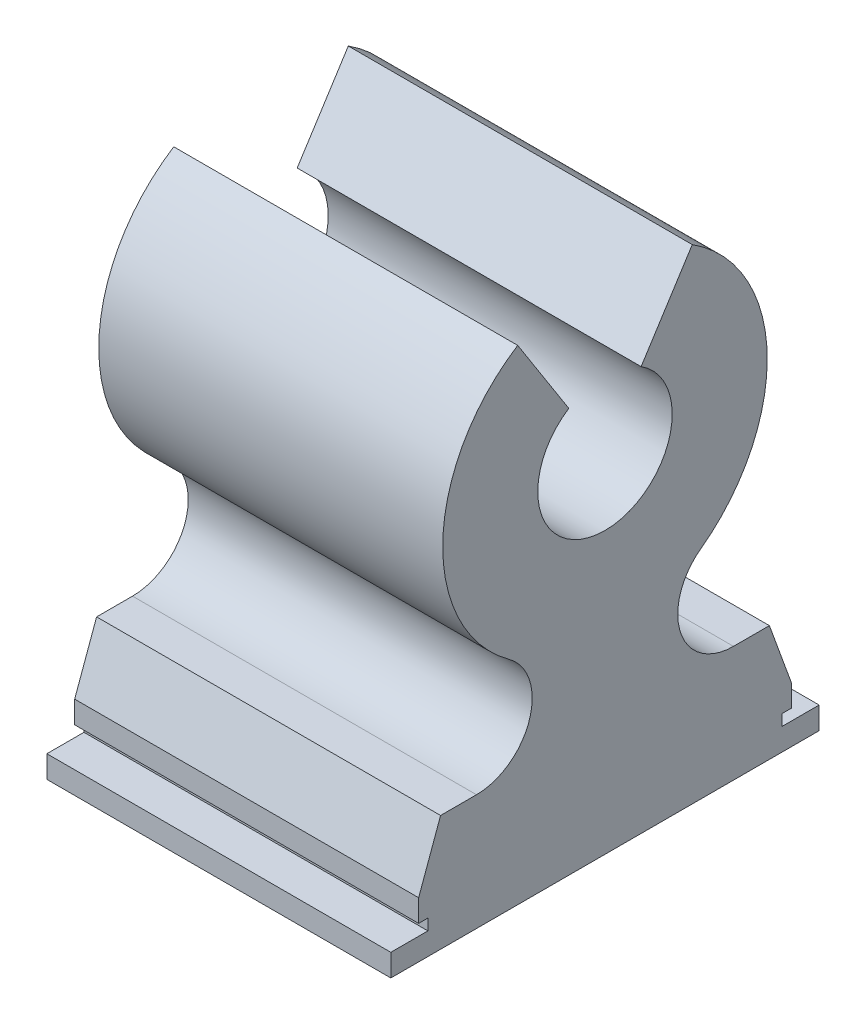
from build123d import *

# Parameters (mm, degrees)
BODY_DEPTH = 9.4234


with BuildPart() as part:
    # BodySke → Body (new body)
    with BuildSketch(Plane(origin=(0, 0, 0), x_dir=(0, 0, -1), z_dir=(1, 0, 0))):
        with BuildLine():
            Line((-5.8674, -9.525), (5.8674, -9.525))
            Line((5.8674, -9.525), (5.8674, -8.9154))
            Line((5.8674, -8.9154), (4.8514, -8.9154))
            Line((4.8514, -8.9154), (4.8514, -8.6106))
            Line((4.8514, -8.6106), (5.1054, -8.6106))
            Line((5.1054, -8.6106), (5.1054, -8.001))
            Line((5.1054, -8.001), (4.504485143, -6.35))
            Line((4.504485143, -6.35), (3.520438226, -6.35))
            ThreePointArc((3.520438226, -6.35), (2.069125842, -5.296760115), (2.620488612, -3.59041285))
            ThreePointArc((2.620488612, -3.59041285), (4.442829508, 0.138891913), (2.391103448, 3.747085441))
            Line((2.391103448, 3.747085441), (0.9906, 1.552363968))
            ThreePointArc((0.9906, 1.552363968), (0, -1.8415), (-0.9906, 1.552363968))
            Line((-0.9906, 1.552363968), (-2.391103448, 3.747085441))
            ThreePointArc((-2.391103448, 3.747085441), (-4.442829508, 0.138891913), (-2.620488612, -3.59041285))
            ThreePointArc((-2.620488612, -3.59041285), (-2.069125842, -5.296760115), (-3.520438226, -6.35))
            Line((-3.520438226, -6.35), (-4.504485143, -6.35))
            Line((-4.504485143, -6.35), (-5.1054, -8.001))
            Line((-5.1054, -8.001), (-5.1054, -8.6106))
            Line((-5.1054, -8.6106), (-4.8514, -8.6106))
            Line((-4.8514, -8.6106), (-4.8514, -8.9154))
            Line((-4.8514, -8.9154), (-5.8674, -8.9154))
            Line((-5.8674, -8.9154), (-5.8674, -9.525))
        make_face()
    extrude(amount=BODY_DEPTH)


solid = part.part
